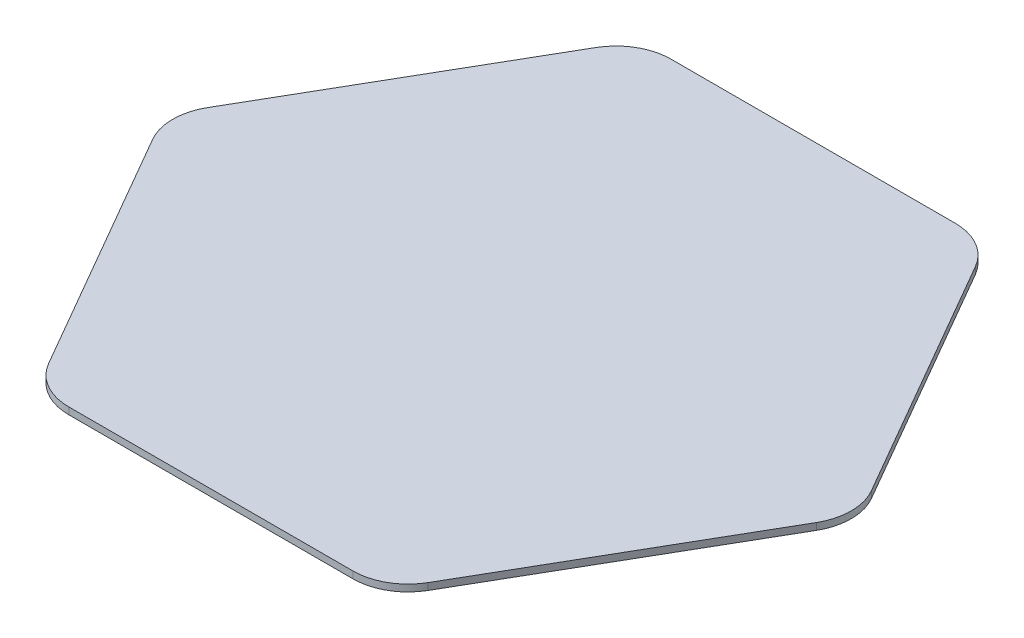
from build123d import *

# Parameters (mm, degrees)
BOSS_EXTRU_1_DEPTH = 2


with BuildPart() as part:
    # Esquisse1 → Boss.-Extru.1 (new body)
    with BuildSketch(Plane(origin=(0, 0, 0), x_dir=(1, 0, 0), z_dir=(0, 1, 0))):
        with BuildLine():
            Line((-55.512228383, 80.05), (-97.081447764, 8.05))
            ThreePointArc((-97.081447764, 8.05), (-99.238438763, 0), (-97.081447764, -8.05))
            Line((-97.081447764, -8.05), (-55.512228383, -80.05))
            ThreePointArc((-55.512228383, -80.05), (-49.619219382, -85.943009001), (-41.569219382, -88.1))
            Line((-41.569219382, -88.1), (41.569219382, -88.1))
            ThreePointArc((41.569219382, -88.1), (49.619219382, -85.943009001), (55.512228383, -80.05))
            Line((55.512228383, -80.05), (97.081447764, -8.05))
            ThreePointArc((97.081447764, -8.05), (99.238438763, 0), (97.081447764, 8.05))
            Line((97.081447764, 8.05), (55.512228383, 80.05))
            ThreePointArc((55.512228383, 80.05), (49.619219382, 85.943009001), (41.569219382, 88.1))
            Line((41.569219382, 88.1), (-41.569219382, 88.1))
            ThreePointArc((-41.569219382, 88.1), (-49.619219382, 85.943009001), (-55.512228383, 80.05))
        make_face()
    extrude(amount=BOSS_EXTRU_1_DEPTH)


solid = part.part
